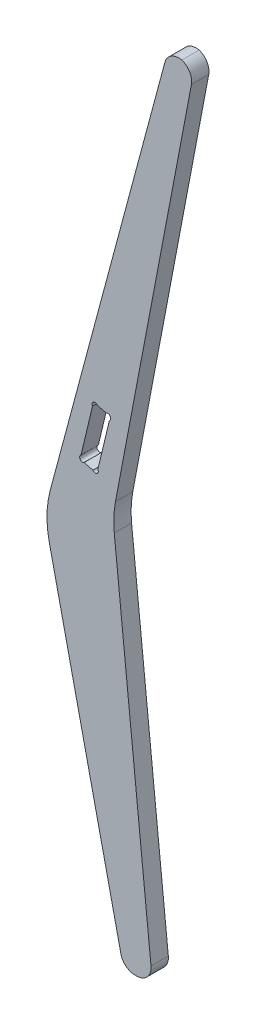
ISO-10303-21;
HEADER;
FILE_DESCRIPTION(('STEP AP214'),'2;1');
FILE_NAME('part.step','',(''),(''),'','','');
FILE_SCHEMA(('AUTOMOTIVE_DESIGN { 1 0 10303 214 1 1 1 1 }'));
ENDSEC;
DATA;
#1=APPLICATION_CONTEXT('core data for automotive mechanical design processes');
#2=APPLICATION_PROTOCOL_DEFINITION('international standard','automotive_design',2000,#1);
#3=PRODUCT_CONTEXT('',#1,'mechanical');
#4=PRODUCT('Part','Part','',(#3));
#5=PRODUCT_RELATED_PRODUCT_CATEGORY('part','',(#4));
#6=PRODUCT_DEFINITION_FORMATION('','',#4);
#7=PRODUCT_DEFINITION_CONTEXT('part definition',#1,'design');
#8=PRODUCT_DEFINITION('design','',#6,#7);
#9=PRODUCT_DEFINITION_SHAPE('','',#8);
#10=(LENGTH_UNIT() NAMED_UNIT(*) SI_UNIT(.MILLI.,.METRE.));
#11=(NAMED_UNIT(*) PLANE_ANGLE_UNIT() SI_UNIT($,.RADIAN.));
#12=(NAMED_UNIT(*) SI_UNIT($,.STERADIAN.) SOLID_ANGLE_UNIT());
#13=UNCERTAINTY_MEASURE_WITH_UNIT(LENGTH_MEASURE(1.E-05),#10,'distance_accuracy_value','');
#14=(GEOMETRIC_REPRESENTATION_CONTEXT(3) GLOBAL_UNCERTAINTY_ASSIGNED_CONTEXT((#13)) GLOBAL_UNIT_ASSIGNED_CONTEXT((#10,
#11,#12)) REPRESENTATION_CONTEXT('',''));
#15=CARTESIAN_POINT('',(0.,0.,0.));
#16=DIRECTION('',(0.,0.,1.));
#17=DIRECTION('',(1.,0.,0.));
#18=AXIS2_PLACEMENT_3D('',#15,#16,#17);
#19=CARTESIAN_POINT('',(19.9991991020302,83.5068127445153,18.));
#20=DIRECTION('',(0.232905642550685,0.97249933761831,0.));
#21=DIRECTION('',(-0.97249933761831,0.232905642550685,0.));
#22=AXIS2_PLACEMENT_3D('',#19,#20,#21);
#23=PLANE('',#22);
#24=DIRECTION('',(0.97249933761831,-0.232905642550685,0.));
#25=VECTOR('',#24,1.);
#26=CARTESIAN_POINT('',(19.9991991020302,83.5068127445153,0.));
#27=LINE('',#26,#25);
#28=CARTESIAN_POINT('',(196.781458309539,41.1689066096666,0.));
#29=VERTEX_POINT('',#28);
#30=CARTESIAN_POINT('',(206.034515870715,38.9528749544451,0.));
#31=VERTEX_POINT('',#30);
#32=EDGE_CURVE('E180',#29,#31,#27,.T.);
#33=ORIENTED_EDGE('',*,*,#32,.T.);
#34=DIRECTION('',(0.,0.,1.));
#35=VECTOR('',#34,1.);
#36=CARTESIAN_POINT('',(206.034515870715,38.9528749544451,0.));
#37=LINE('',#36,#35);
#38=CARTESIAN_POINT('',(206.034515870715,38.9528749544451,18.));
#39=VERTEX_POINT('',#38);
#40=EDGE_CURVE('E269',#31,#39,#37,.T.);
#41=ORIENTED_EDGE('',*,*,#40,.T.);
#42=DIRECTION('',(0.97249933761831,-0.232905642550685,0.));
#43=VECTOR('',#42,1.);
#44=CARTESIAN_POINT('',(19.9991991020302,83.5068127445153,18.));
#45=LINE('',#44,#43);
#46=CARTESIAN_POINT('',(196.781458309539,41.1689066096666,18.));
#47=VERTEX_POINT('',#46);
#48=EDGE_CURVE('E182',#47,#39,#45,.T.);
#49=ORIENTED_EDGE('',*,*,#48,.F.);
#50=DIRECTION('',(0.,0.,1.));
#51=VECTOR('',#50,1.);
#52=CARTESIAN_POINT('',(196.781458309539,41.1689066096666,0.));
#53=LINE('',#52,#51);
#54=EDGE_CURVE('E167',#47,#29,#53,.F.);
#55=ORIENTED_EDGE('',*,*,#54,.T.);
#56=EDGE_LOOP('',(#33,#41,#49,#55));
#57=FACE_BOUND('',#56,.T.);
#58=ADVANCED_FACE('F35',(#57),#23,.F.);
#59=CARTESIAN_POINT('',(190.161282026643,-45.5420727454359,18.));
#60=DIRECTION('',(0.972499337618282,-0.232905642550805,0.));
#61=DIRECTION('',(0.232905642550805,0.972499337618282,0.));
#62=AXIS2_PLACEMENT_3D('',#59,#60,#61);
#63=PLANE('',#62);
#64=DIRECTION('',(-0.232905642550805,-0.972499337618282,0.));
#65=VECTOR('',#64,1.);
#66=CARTESIAN_POINT('',(190.161282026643,-45.5420727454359,0.));
#67=LINE('',#66,#65);
#68=CARTESIAN_POINT('',(209.172346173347,33.8387747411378,0.));
#69=VERTEX_POINT('',#68);
#70=CARTESIAN_POINT('',(197.174277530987,-16.2592550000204,0.));
#71=VERTEX_POINT('',#70);
#72=EDGE_CURVE('E188',#69,#71,#67,.T.);
#73=ORIENTED_EDGE('',*,*,#72,.T.);
#74=DIRECTION('',(0.,0.,1.));
#75=VECTOR('',#74,1.);
#76=CARTESIAN_POINT('',(197.174277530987,-16.2592550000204,0.));
#77=LINE('',#76,#75);
#78=CARTESIAN_POINT('',(197.174277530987,-16.2592550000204,18.));
#79=VERTEX_POINT('',#78);
#80=EDGE_CURVE('E50',#71,#79,#77,.T.);
#81=ORIENTED_EDGE('',*,*,#80,.T.);
#82=DIRECTION('',(-0.232905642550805,-0.972499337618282,0.));
#83=VECTOR('',#82,1.);
#84=CARTESIAN_POINT('',(190.161282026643,-45.5420727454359,18.));
#85=LINE('',#84,#83);
#86=CARTESIAN_POINT('',(209.172346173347,33.8387747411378,18.));
#87=VERTEX_POINT('',#86);
#88=EDGE_CURVE('E267',#87,#79,#85,.T.);
#89=ORIENTED_EDGE('',*,*,#88,.F.);
#90=DIRECTION('',(0.,0.,1.));
#91=VECTOR('',#90,1.);
#92=CARTESIAN_POINT('',(209.172346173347,33.8387747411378,0.));
#93=LINE('',#92,#91);
#94=EDGE_CURVE('E183',#87,#69,#93,.F.);
#95=ORIENTED_EDGE('',*,*,#94,.T.);
#96=EDGE_LOOP('',(#73,#81,#89,#95));
#97=FACE_BOUND('',#96,.T.);
#98=ADVANCED_FACE('F263',(#97),#63,.F.);
#99=CARTESIAN_POINT('',(6.02486054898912,25.1568524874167,18.));
#100=DIRECTION('',(0.232905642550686,0.97249933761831,0.));
#101=DIRECTION('',(-0.97249933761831,0.232905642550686,0.));
#102=AXIS2_PLACEMENT_3D('',#99,#100,#101);
#103=PLANE('',#102);
#104=DIRECTION('',(0.,0.,1.));
#105=VECTOR('',#104,1.);
#106=CARTESIAN_POINT('',(182.807119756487,-17.1810536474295,0.));
#107=LINE('',#106,#105);
#108=CARTESIAN_POINT('',(182.807119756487,-17.1810536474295,18.));
#109=VERTEX_POINT('',#108);
#110=CARTESIAN_POINT('',(182.807119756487,-17.1810536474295,0.));
#111=VERTEX_POINT('',#110);
#112=EDGE_CURVE('E280',#109,#111,#107,.F.);
#113=ORIENTED_EDGE('',*,*,#112,.F.);
#114=DIRECTION('',(0.97249933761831,-0.232905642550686,0.));
#115=VECTOR('',#114,1.);
#116=CARTESIAN_POINT('',(6.02486054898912,25.1568524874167,18.));
#117=LINE('',#116,#115);
#118=CARTESIAN_POINT('',(192.060177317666,-19.3970853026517,18.));
#119=VERTEX_POINT('',#118);
#120=EDGE_CURVE('E298',#109,#119,#117,.T.);
#121=ORIENTED_EDGE('',*,*,#120,.T.);
#122=DIRECTION('',(0.,0.,1.));
#123=VECTOR('',#122,1.);
#124=CARTESIAN_POINT('',(192.060177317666,-19.3970853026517,0.));
#125=LINE('',#124,#123);
#126=CARTESIAN_POINT('',(192.060177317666,-19.3970853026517,0.));
#127=VERTEX_POINT('',#126);
#128=EDGE_CURVE('E271',#127,#119,#125,.T.);
#129=ORIENTED_EDGE('',*,*,#128,.F.);
#130=DIRECTION('',(0.97249933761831,-0.232905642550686,0.));
#131=VECTOR('',#130,1.);
#132=CARTESIAN_POINT('',(6.02486054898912,25.1568524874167,0.));
#133=LINE('',#132,#131);
#134=EDGE_CURVE('E192',#111,#127,#133,.T.);
#135=ORIENTED_EDGE('',*,*,#134,.F.);
#136=EDGE_LOOP('',(#113,#121,#129,#135));
#137=FACE_BOUND('',#136,.T.);
#138=ADVANCED_FACE('F379',(#137),#103,.T.);
#139=CARTESIAN_POINT('',(205.380018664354,21.1630051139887,18.));
#140=DIRECTION('',(0.994732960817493,0.10250042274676,0.));
#141=DIRECTION('',(-0.10250042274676,0.994732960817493,0.));
#142=AXIS2_PLACEMENT_3D('',#139,#140,#141);
#143=PLANE('',#142);
#144=DIRECTION('',(0.10250042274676,-0.994732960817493,0.));
#145=VECTOR('',#144,1.);
#146=CARTESIAN_POINT('',(205.380018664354,21.1630051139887,18.));
#147=LINE('',#146,#145);
#148=CARTESIAN_POINT('',(214.256184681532,-64.9772728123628,18.));
#149=VERTEX_POINT('',#148);
#150=CARTESIAN_POINT('',(252.445302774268,-435.590129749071,18.));
#151=VERTEX_POINT('',#150);
#152=EDGE_CURVE('E201',#149,#151,#147,.T.);
#153=ORIENTED_EDGE('',*,*,#152,.T.);
#154=DIRECTION('',(0.,0.,1.));
#155=VECTOR('',#154,1.);
#156=CARTESIAN_POINT('',(252.445302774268,-435.590129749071,18.));
#157=LINE('',#156,#155);
#158=CARTESIAN_POINT('',(252.445302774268,-435.590129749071,0.));
#159=VERTEX_POINT('',#158);
#160=EDGE_CURVE('E250',#151,#159,#157,.F.);
#161=ORIENTED_EDGE('',*,*,#160,.T.);
#162=DIRECTION('',(0.10250042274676,-0.994732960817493,0.));
#163=VECTOR('',#162,1.);
#164=CARTESIAN_POINT('',(205.380018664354,21.1630051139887,0.));
#165=LINE('',#164,#163);
#166=CARTESIAN_POINT('',(214.256184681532,-64.9772728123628,0.));
#167=VERTEX_POINT('',#166);
#168=EDGE_CURVE('E240',#167,#159,#165,.T.);
#169=ORIENTED_EDGE('',*,*,#168,.F.);
#170=DIRECTION('',(0.,0.,-1.));
#171=VECTOR('',#170,1.);
#172=CARTESIAN_POINT('',(214.256184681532,-64.9772728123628,18.));
#173=LINE('',#172,#171);
#174=EDGE_CURVE('E216',#167,#149,#173,.F.);
#175=ORIENTED_EDGE('',*,*,#174,.T.);
#176=EDGE_LOOP('',(#153,#161,#169,#175));
#177=FACE_BOUND('',#176,.T.);
#178=ADVANCED_FACE('F335',(#177),#143,.T.);
#179=CARTESIAN_POINT('',(214.580040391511,-40.8280444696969,18.));
#180=DIRECTION('',(0.982375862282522,-0.18691619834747,0.));
#181=DIRECTION('',(0.18691619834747,0.982375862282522,0.));
#182=AXIS2_PLACEMENT_3D('',#179,#180,#181);
#183=PLANE('',#182);
#184=DIRECTION('',(-0.18691619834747,-0.982375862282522,0.));
#185=VECTOR('',#184,1.);
#186=CARTESIAN_POINT('',(214.580040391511,-40.8280444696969,0.));
#187=LINE('',#186,#185);
#188=CARTESIAN_POINT('',(294.461269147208,379.003899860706,0.));
#189=VERTEX_POINT('',#188);
#190=CARTESIAN_POINT('',(215.491894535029,-36.0356107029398,0.));
#191=VERTEX_POINT('',#190);
#192=EDGE_CURVE('E305',#189,#191,#187,.T.);
#193=ORIENTED_EDGE('',*,*,#192,.F.);
#194=DIRECTION('',(0.,0.,-1.));
#195=VECTOR('',#194,1.);
#196=CARTESIAN_POINT('',(294.461269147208,379.003899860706,18.));
#197=LINE('',#196,#195);
#198=CARTESIAN_POINT('',(294.461269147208,379.003899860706,18.));
#199=VERTEX_POINT('',#198);
#200=EDGE_CURVE('E227',#189,#199,#197,.F.);
#201=ORIENTED_EDGE('',*,*,#200,.T.);
#202=DIRECTION('',(-0.18691619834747,-0.982375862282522,0.));
#203=VECTOR('',#202,1.);
#204=CARTESIAN_POINT('',(214.580040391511,-40.8280444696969,18.));
#205=LINE('',#204,#203);
#206=CARTESIAN_POINT('',(215.491894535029,-36.0356107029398,18.));
#207=VERTEX_POINT('',#206);
#208=EDGE_CURVE('E289',#199,#207,#205,.T.);
#209=ORIENTED_EDGE('',*,*,#208,.T.);
#210=DIRECTION('',(0.,0.,-1.));
#211=VECTOR('',#210,1.);
#212=CARTESIAN_POINT('',(215.491894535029,-36.0356107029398,0.));
#213=LINE('',#212,#211);
#214=EDGE_CURVE('E213',#207,#191,#213,.T.);
#215=ORIENTED_EDGE('',*,*,#214,.T.);
#216=EDGE_LOOP('',(#193,#201,#209,#215));
#217=FACE_BOUND('',#216,.T.);
#218=ADVANCED_FACE('F325',(#217),#183,.T.);
#219=CARTESIAN_POINT('',(152.70694147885,-40.9177016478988,18.));
#220=DIRECTION('',(-0.965925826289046,0.258819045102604,0.));
#221=DIRECTION('',(-0.258819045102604,-0.965925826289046,0.));
#222=AXIS2_PLACEMENT_3D('',#219,#220,#221);
#223=PLANE('',#222);
#224=DIRECTION('',(0.258819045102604,0.965925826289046,0.));
#225=VECTOR('',#224,1.);
#226=CARTESIAN_POINT('',(152.70694147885,-40.9177016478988,18.));
#227=LINE('',#226,#225);
#228=CARTESIAN_POINT('',(147.72580841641,-59.5075433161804,18.));
#229=VERTEX_POINT('',#228);
#230=CARTESIAN_POINT('',(266.896916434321,385.245086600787,18.));
#231=VERTEX_POINT('',#230);
#232=EDGE_CURVE('E291',#229,#231,#227,.T.);
#233=ORIENTED_EDGE('',*,*,#232,.T.);
#234=DIRECTION('',(0.,0.,-1.));
#235=VECTOR('',#234,1.);
#236=CARTESIAN_POINT('',(266.896916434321,385.245086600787,18.));
#237=LINE('',#236,#235);
#238=CARTESIAN_POINT('',(266.896916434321,385.245086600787,0.));
#239=VERTEX_POINT('',#238);
#240=EDGE_CURVE('E234',#231,#239,#237,.T.);
#241=ORIENTED_EDGE('',*,*,#240,.T.);
#242=DIRECTION('',(0.258819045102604,0.965925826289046,0.));
#243=VECTOR('',#242,1.);
#244=CARTESIAN_POINT('',(152.70694147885,-40.9177016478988,0.));
#245=LINE('',#244,#243);
#246=CARTESIAN_POINT('',(147.72580841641,-59.5075433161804,0.));
#247=VERTEX_POINT('',#246);
#248=EDGE_CURVE('E194',#247,#239,#245,.T.);
#249=ORIENTED_EDGE('',*,*,#248,.F.);
#250=DIRECTION('',(0.,0.,-1.));
#251=VECTOR('',#250,1.);
#252=CARTESIAN_POINT('',(147.72580841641,-59.5075433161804,18.));
#253=LINE('',#252,#251);
#254=EDGE_CURVE('E208',#247,#229,#253,.F.);
#255=ORIENTED_EDGE('',*,*,#254,.T.);
#256=EDGE_LOOP('',(#233,#241,#249,#255));
#257=FACE_BOUND('',#256,.T.);
#258=ADVANCED_FACE('F358',(#257),#223,.T.);
#259=CARTESIAN_POINT('',(116.93444675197,26.1283123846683,18.));
#260=DIRECTION('',(-0.975933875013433,-0.218066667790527,0.));
#261=DIRECTION('',(0.218066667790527,-0.975933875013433,0.));
#262=AXIS2_PLACEMENT_3D('',#259,#260,#261);
#263=PLANE('',#262);
#264=DIRECTION('',(-0.218066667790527,0.975933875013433,0.));
#265=VECTOR('',#264,1.);
#266=CARTESIAN_POINT('',(116.93444675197,26.1283123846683,0.));
#267=LINE('',#266,#265);
#268=CARTESIAN_POINT('',(221.1771415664,-440.39863610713,0.));
#269=VERTEX_POINT('',#268);
#270=CARTESIAN_POINT('',(146.725003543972,-107.196114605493,0.));
#271=VERTEX_POINT('',#270);
#272=EDGE_CURVE('E189',#269,#271,#267,.T.);
#273=ORIENTED_EDGE('',*,*,#272,.F.);
#274=DIRECTION('',(0.,0.,1.));
#275=VECTOR('',#274,1.);
#276=CARTESIAN_POINT('',(221.1771415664,-440.39863610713,18.));
#277=LINE('',#276,#275);
#278=CARTESIAN_POINT('',(221.1771415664,-440.39863610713,18.));
#279=VERTEX_POINT('',#278);
#280=EDGE_CURVE('E174',#269,#279,#277,.T.);
#281=ORIENTED_EDGE('',*,*,#280,.T.);
#282=DIRECTION('',(-0.218066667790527,0.975933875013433,0.));
#283=VECTOR('',#282,1.);
#284=CARTESIAN_POINT('',(116.93444675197,26.1283123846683,18.));
#285=LINE('',#284,#283);
#286=CARTESIAN_POINT('',(146.725003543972,-107.196114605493,18.));
#287=VERTEX_POINT('',#286);
#288=EDGE_CURVE('E294',#279,#287,#285,.T.);
#289=ORIENTED_EDGE('',*,*,#288,.T.);
#290=DIRECTION('',(0.,0.,-1.));
#291=VECTOR('',#290,1.);
#292=CARTESIAN_POINT('',(146.725003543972,-107.196114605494,18.));
#293=LINE('',#292,#291);
#294=EDGE_CURVE('E202',#287,#271,#293,.T.);
#295=ORIENTED_EDGE('',*,*,#294,.T.);
#296=EDGE_LOOP('',(#273,#281,#289,#295));
#297=FACE_BOUND('',#296,.T.);
#298=ADVANCED_FACE('F351',(#297),#263,.T.);
#299=CARTESIAN_POINT('',(172.656293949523,-41.3497711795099,18.));
#300=DIRECTION('',(0.972499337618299,-0.232905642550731,0.));
#301=DIRECTION('',(0.232905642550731,0.972499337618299,0.));
#302=AXIS2_PLACEMENT_3D('',#299,#300,#301);
#303=PLANE('',#302);
#304=DIRECTION('',(0.,0.,1.));
#305=VECTOR('',#304,1.);
#306=CARTESIAN_POINT('',(179.669289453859,-12.0669534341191,0.));
#307=LINE('',#306,#305);
#308=CARTESIAN_POINT('',(179.669289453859,-12.0669534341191,0.));
#309=VERTEX_POINT('',#308);
#310=CARTESIAN_POINT('',(179.669289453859,-12.0669534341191,18.));
#311=VERTEX_POINT('',#310);
#312=EDGE_CURVE('E277',#309,#311,#307,.T.);
#313=ORIENTED_EDGE('',*,*,#312,.F.);
#314=DIRECTION('',(-0.232905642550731,-0.972499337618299,0.));
#315=VECTOR('',#314,1.);
#316=CARTESIAN_POINT('',(172.656293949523,-41.3497711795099,0.));
#317=LINE('',#316,#315);
#318=CARTESIAN_POINT('',(191.667358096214,38.0310763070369,0.));
#319=VERTEX_POINT('',#318);
#320=EDGE_CURVE('E199',#319,#309,#317,.T.);
#321=ORIENTED_EDGE('',*,*,#320,.F.);
#322=DIRECTION('',(0.,0.,1.));
#323=VECTOR('',#322,1.);
#324=CARTESIAN_POINT('',(191.667358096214,38.031076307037,0.));
#325=LINE('',#324,#323);
#326=CARTESIAN_POINT('',(191.667358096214,38.031076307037,18.));
#327=VERTEX_POINT('',#326);
#328=EDGE_CURVE('E170',#327,#319,#325,.F.);
#329=ORIENTED_EDGE('',*,*,#328,.F.);
#330=DIRECTION('',(-0.232905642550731,-0.972499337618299,0.));
#331=VECTOR('',#330,1.);
#332=CARTESIAN_POINT('',(172.656293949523,-41.3497711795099,18.));
#333=LINE('',#332,#331);
#334=EDGE_CURVE('E206',#327,#311,#333,.T.);
#335=ORIENTED_EDGE('',*,*,#334,.T.);
#336=EDGE_LOOP('',(#313,#321,#329,#335));
#337=FACE_BOUND('',#336,.T.);
#338=ADVANCED_FACE('F362',(#337),#303,.T.);
#339=CARTESIAN_POINT('',(0.,0.,18.));
#340=DIRECTION('',(0.,0.,1.));
#341=DIRECTION('',(1.,0.,0.));
#342=AXIS2_PLACEMENT_3D('',#339,#340,#341);
#343=PLANE('',#342);
#344=CARTESIAN_POINT('',(181.238204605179,-14.6240035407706,18.));
#345=DIRECTION('',(0.,0.,1.));
#346=DIRECTION('',(-1.,0.,0.));
#347=AXIS2_PLACEMENT_3D('',#344,#345,#346);
#348=CIRCLE('',#347,2.99999999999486);
#349=EDGE_CURVE('E427',#311,#109,#348,.T.);
#350=ORIENTED_EDGE('',*,*,#349,.F.);
#351=ORIENTED_EDGE('',*,*,#334,.F.);
#352=CARTESIAN_POINT('',(194.224408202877,39.5999914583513,18.));
#353=DIRECTION('',(0.,0.,1.));
#354=DIRECTION('',(1.,0.,0.));
#355=AXIS2_PLACEMENT_3D('',#352,#353,#354);
#356=CIRCLE('',#355,3.00000000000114);
#357=EDGE_CURVE('E422',#47,#327,#356,.T.);
#358=ORIENTED_EDGE('',*,*,#357,.F.);
#359=ORIENTED_EDGE('',*,*,#48,.T.);
#360=CARTESIAN_POINT('',(207.603431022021,36.3958248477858,18.));
#361=DIRECTION('',(0.,0.,1.));
#362=DIRECTION('',(-1.,0.,0.));
#363=AXIS2_PLACEMENT_3D('',#360,#361,#362);
#364=CIRCLE('',#363,2.99999999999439);
#365=EDGE_CURVE('E420',#87,#39,#364,.T.);
#366=ORIENTED_EDGE('',*,*,#365,.F.);
#367=ORIENTED_EDGE('',*,*,#88,.T.);
#368=CARTESIAN_POINT('',(194.617227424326,-17.8281701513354,18.));
#369=DIRECTION('',(0.,0.,1.));
#370=DIRECTION('',(1.,0.,0.));
#371=AXIS2_PLACEMENT_3D('',#368,#369,#370);
#372=CIRCLE('',#371,2.99999999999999);
#373=EDGE_CURVE('E424',#119,#79,#372,.T.);
#374=ORIENTED_EDGE('',*,*,#373,.F.);
#375=ORIENTED_EDGE('',*,*,#120,.F.);
#376=EDGE_LOOP('',(#350,#351,#358,#359,#366,#367,#374,#375));
#377=FACE_BOUND('',#376,.T.);
#378=DIRECTION('',(1.,0.,0.));
#379=VECTOR('',#378,1.);
#380=CARTESIAN_POINT('',(254.149379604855,-452.127636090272,18.));
#381=LINE('',#380,#379);
#382=CARTESIAN_POINT('',(235.816149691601,-452.127636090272,18.));
#383=VERTEX_POINT('',#382);
#384=CARTESIAN_POINT('',(237.524308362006,-452.127636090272,18.));
#385=VERTEX_POINT('',#384);
#386=EDGE_CURVE('E282',#383,#385,#381,.T.);
#387=ORIENTED_EDGE('',*,*,#386,.T.);
#388=CARTESIAN_POINT('',(237.524308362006,-437.127636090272,18.));
#389=DIRECTION('',(0.,0.,1.));
#390=DIRECTION('',(1.,0.,0.));
#391=AXIS2_PLACEMENT_3D('',#388,#389,#390);
#392=CIRCLE('',#391,15.);
#393=EDGE_CURVE('E248',#385,#151,#392,.T.);
#394=ORIENTED_EDGE('',*,*,#393,.T.);
#395=ORIENTED_EDGE('',*,*,#152,.F.);
#396=CARTESIAN_POINT('',(313.729480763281,-54.7272305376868,18.));
#397=DIRECTION('',(0.,0.,1.));
#398=DIRECTION('',(1.,0.,0.));
#399=AXIS2_PLACEMENT_3D('',#396,#397,#398);
#400=CIRCLE('',#399,100.);
#401=EDGE_CURVE('E220',#149,#207,#400,.F.);
#402=ORIENTED_EDGE('',*,*,#401,.T.);
#403=ORIENTED_EDGE('',*,*,#208,.F.);
#404=CARTESIAN_POINT('',(279.72563121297,381.807642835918,18.));
#405=DIRECTION('',(0.,0.,1.));
#406=DIRECTION('',(1.,0.,0.));
#407=AXIS2_PLACEMENT_3D('',#404,#405,#406);
#408=CIRCLE('',#407,15.);
#409=CARTESIAN_POINT('',(284.431626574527,396.050311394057,18.));
#410=VERTEX_POINT('',#409);
#411=EDGE_CURVE('E232',#199,#410,#408,.T.);
#412=ORIENTED_EDGE('',*,*,#411,.T.);
#413=CARTESIAN_POINT('',(281.385803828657,381.362800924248,18.));
#414=DIRECTION('',(0.,0.,1.));
#415=DIRECTION('',(1.,0.,0.));
#416=AXIS2_PLACEMENT_3D('',#413,#414,#415);
#417=CIRCLE('',#416,15.);
#418=EDGE_CURVE('E230',#410,#231,#417,.T.);
#419=ORIENTED_EDGE('',*,*,#418,.T.);
#420=ORIENTED_EDGE('',*,*,#232,.F.);
#421=CARTESIAN_POINT('',(244.318391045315,-85.3894478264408,18.));
#422=DIRECTION('',(0.,0.,1.));
#423=DIRECTION('',(1.,0.,0.));
#424=AXIS2_PLACEMENT_3D('',#421,#422,#423);
#425=CIRCLE('',#424,100.);
#426=EDGE_CURVE('E210',#229,#287,#425,.T.);
#427=ORIENTED_EDGE('',*,*,#426,.T.);
#428=ORIENTED_EDGE('',*,*,#288,.F.);
#429=CARTESIAN_POINT('',(235.816149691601,-437.127636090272,18.));
#430=DIRECTION('',(0.,0.,1.));
#431=DIRECTION('',(1.,0.,0.));
#432=AXIS2_PLACEMENT_3D('',#429,#430,#431);
#433=CIRCLE('',#432,15.);
#434=EDGE_CURVE('E246',#279,#383,#433,.T.);
#435=ORIENTED_EDGE('',*,*,#434,.T.);
#436=EDGE_LOOP('',(#387,#394,#395,#402,#403,#412,#419,#420,#427,#428,#435));
#437=FACE_BOUND('',#436,.T.);
#438=ADVANCED_FACE('F360',(#377,#437),#343,.T.);
#439=CARTESIAN_POINT('',(0.,0.,0.));
#440=DIRECTION('',(0.,0.,1.));
#441=DIRECTION('',(1.,0.,0.));
#442=AXIS2_PLACEMENT_3D('',#439,#440,#441);
#443=PLANE('',#442);
#444=ORIENTED_EDGE('',*,*,#168,.T.);
#445=CARTESIAN_POINT('',(237.524308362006,-437.127636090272,0.));
#446=DIRECTION('',(0.,0.,1.));
#447=DIRECTION('',(1.,0.,0.));
#448=AXIS2_PLACEMENT_3D('',#445,#446,#447);
#449=CIRCLE('',#448,15.);
#450=CARTESIAN_POINT('',(237.524308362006,-452.127636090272,0.));
#451=VERTEX_POINT('',#450);
#452=EDGE_CURVE('E254',#159,#451,#449,.F.);
#453=ORIENTED_EDGE('',*,*,#452,.T.);
#454=DIRECTION('',(1.,0.,0.));
#455=VECTOR('',#454,1.);
#456=CARTESIAN_POINT('',(254.149379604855,-452.127636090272,0.));
#457=LINE('',#456,#455);
#458=CARTESIAN_POINT('',(235.816149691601,-452.127636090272,0.));
#459=VERTEX_POINT('',#458);
#460=EDGE_CURVE('E241',#459,#451,#457,.T.);
#461=ORIENTED_EDGE('',*,*,#460,.F.);
#462=CARTESIAN_POINT('',(235.816149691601,-437.127636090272,0.));
#463=DIRECTION('',(0.,0.,1.));
#464=DIRECTION('',(1.,0.,0.));
#465=AXIS2_PLACEMENT_3D('',#462,#463,#464);
#466=CIRCLE('',#465,15.);
#467=EDGE_CURVE('E252',#459,#269,#466,.F.);
#468=ORIENTED_EDGE('',*,*,#467,.T.);
#469=ORIENTED_EDGE('',*,*,#272,.T.);
#470=CARTESIAN_POINT('',(244.318391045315,-85.3894478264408,0.));
#471=DIRECTION('',(0.,0.,1.));
#472=DIRECTION('',(1.,0.,0.));
#473=AXIS2_PLACEMENT_3D('',#470,#471,#472);
#474=CIRCLE('',#473,100.);
#475=EDGE_CURVE('E205',#271,#247,#474,.F.);
#476=ORIENTED_EDGE('',*,*,#475,.T.);
#477=ORIENTED_EDGE('',*,*,#248,.T.);
#478=CARTESIAN_POINT('',(281.385803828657,381.362800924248,0.));
#479=DIRECTION('',(0.,0.,1.));
#480=DIRECTION('',(1.,0.,0.));
#481=AXIS2_PLACEMENT_3D('',#478,#479,#480);
#482=CIRCLE('',#481,15.);
#483=CARTESIAN_POINT('',(284.431626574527,396.050311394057,0.));
#484=VERTEX_POINT('',#483);
#485=EDGE_CURVE('E223',#239,#484,#482,.F.);
#486=ORIENTED_EDGE('',*,*,#485,.T.);
#487=CARTESIAN_POINT('',(279.72563121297,381.807642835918,0.));
#488=DIRECTION('',(0.,0.,1.));
#489=DIRECTION('',(1.,0.,0.));
#490=AXIS2_PLACEMENT_3D('',#487,#488,#489);
#491=CIRCLE('',#490,15.);
#492=EDGE_CURVE('E225',#484,#189,#491,.F.);
#493=ORIENTED_EDGE('',*,*,#492,.T.);
#494=ORIENTED_EDGE('',*,*,#192,.T.);
#495=CARTESIAN_POINT('',(313.729480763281,-54.7272305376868,0.));
#496=DIRECTION('',(0.,0.,1.));
#497=DIRECTION('',(1.,0.,0.));
#498=AXIS2_PLACEMENT_3D('',#495,#496,#497);
#499=CIRCLE('',#498,100.);
#500=EDGE_CURVE('E218',#191,#167,#499,.T.);
#501=ORIENTED_EDGE('',*,*,#500,.T.);
#502=EDGE_LOOP('',(#444,#453,#461,#468,#469,#476,#477,#486,#493,#494,#501));
#503=FACE_BOUND('',#502,.T.);
#504=ORIENTED_EDGE('',*,*,#320,.T.);
#505=CARTESIAN_POINT('',(181.238204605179,-14.6240035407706,0.));
#506=DIRECTION('',(0.,0.,1.));
#507=DIRECTION('',(1.,0.,0.));
#508=AXIS2_PLACEMENT_3D('',#505,#506,#507);
#509=CIRCLE('',#508,2.99999999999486);
#510=EDGE_CURVE('E11',#309,#111,#509,.T.);
#511=ORIENTED_EDGE('',*,*,#510,.T.);
#512=ORIENTED_EDGE('',*,*,#134,.T.);
#513=CARTESIAN_POINT('',(194.617227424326,-17.8281701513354,0.));
#514=DIRECTION('',(0.,0.,1.));
#515=DIRECTION('',(1.,0.,0.));
#516=AXIS2_PLACEMENT_3D('',#513,#514,#515);
#517=CIRCLE('',#516,2.99999999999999);
#518=EDGE_CURVE('E43',#127,#71,#517,.T.);
#519=ORIENTED_EDGE('',*,*,#518,.T.);
#520=ORIENTED_EDGE('',*,*,#72,.F.);
#521=CARTESIAN_POINT('',(207.603431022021,36.3958248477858,0.));
#522=DIRECTION('',(0.,0.,1.));
#523=DIRECTION('',(1.,0.,0.));
#524=AXIS2_PLACEMENT_3D('',#521,#522,#523);
#525=CIRCLE('',#524,2.99999999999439);
#526=EDGE_CURVE('E173',#69,#31,#525,.T.);
#527=ORIENTED_EDGE('',*,*,#526,.T.);
#528=ORIENTED_EDGE('',*,*,#32,.F.);
#529=CARTESIAN_POINT('',(194.224408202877,39.5999914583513,0.));
#530=DIRECTION('',(0.,0.,1.));
#531=DIRECTION('',(1.,0.,0.));
#532=AXIS2_PLACEMENT_3D('',#529,#530,#531);
#533=CIRCLE('',#532,3.00000000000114);
#534=EDGE_CURVE('E164',#29,#319,#533,.T.);
#535=ORIENTED_EDGE('',*,*,#534,.T.);
#536=EDGE_LOOP('',(#504,#511,#512,#519,#520,#527,#528,#535));
#537=FACE_BOUND('',#536,.T.);
#538=ADVANCED_FACE('F186',(#503,#537),#443,.F.);
#539=CARTESIAN_POINT('',(244.318391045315,-85.3894478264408,18.));
#540=DIRECTION('',(0.,0.,-1.));
#541=DIRECTION('',(-1.,0.,0.));
#542=AXIS2_PLACEMENT_3D('',#539,#540,#541);
#543=CYLINDRICAL_SURFACE('',#542,100.);
#544=ORIENTED_EDGE('',*,*,#426,.F.);
#545=ORIENTED_EDGE('',*,*,#254,.F.);
#546=ORIENTED_EDGE('',*,*,#475,.F.);
#547=ORIENTED_EDGE('',*,*,#294,.F.);
#548=EDGE_LOOP('',(#544,#545,#546,#547));
#549=FACE_BOUND('',#548,.T.);
#550=ADVANCED_FACE('F356',(#549),#543,.T.);
#551=CARTESIAN_POINT('',(313.729480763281,-54.7272305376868,18.));
#552=DIRECTION('',(0.,0.,1.));
#553=DIRECTION('',(1.,0.,0.));
#554=AXIS2_PLACEMENT_3D('',#551,#552,#553);
#555=CYLINDRICAL_SURFACE('',#554,100.);
#556=ORIENTED_EDGE('',*,*,#401,.F.);
#557=ORIENTED_EDGE('',*,*,#174,.F.);
#558=ORIENTED_EDGE('',*,*,#500,.F.);
#559=ORIENTED_EDGE('',*,*,#214,.F.);
#560=EDGE_LOOP('',(#556,#557,#558,#559));
#561=FACE_BOUND('',#560,.T.);
#562=ADVANCED_FACE('F330',(#561),#555,.F.);
#563=CARTESIAN_POINT('',(281.385803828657,381.362800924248,18.));
#564=DIRECTION('',(0.,0.,-1.));
#565=DIRECTION('',(-1.,0.,0.));
#566=AXIS2_PLACEMENT_3D('',#563,#564,#565);
#567=CYLINDRICAL_SURFACE('',#566,15.);
#568=ORIENTED_EDGE('',*,*,#240,.F.);
#569=ORIENTED_EDGE('',*,*,#418,.F.);
#570=DIRECTION('',(0.,0.,-1.));
#571=VECTOR('',#570,1.);
#572=CARTESIAN_POINT('',(284.431626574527,396.050311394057,9.));
#573=LINE('',#572,#571);
#574=EDGE_CURVE('E237',#484,#410,#573,.F.);
#575=ORIENTED_EDGE('',*,*,#574,.F.);
#576=ORIENTED_EDGE('',*,*,#485,.F.);
#577=EDGE_LOOP('',(#568,#569,#575,#576));
#578=FACE_BOUND('',#577,.T.);
#579=ADVANCED_FACE('F316',(#578),#567,.T.);
#580=CARTESIAN_POINT('',(279.72563121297,381.807642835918,18.));
#581=DIRECTION('',(0.,0.,-1.));
#582=DIRECTION('',(-1.,0.,0.));
#583=AXIS2_PLACEMENT_3D('',#580,#581,#582);
#584=CYLINDRICAL_SURFACE('',#583,15.);
#585=ORIENTED_EDGE('',*,*,#411,.F.);
#586=ORIENTED_EDGE('',*,*,#200,.F.);
#587=ORIENTED_EDGE('',*,*,#492,.F.);
#588=ORIENTED_EDGE('',*,*,#574,.T.);
#589=EDGE_LOOP('',(#585,#586,#587,#588));
#590=FACE_BOUND('',#589,.T.);
#591=ADVANCED_FACE('F321',(#590),#584,.T.);
#592=CARTESIAN_POINT('',(254.149379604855,-452.127636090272,0.));
#593=DIRECTION('',(0.,-1.,0.));
#594=DIRECTION('',(0.,0.,-1.));
#595=AXIS2_PLACEMENT_3D('',#592,#593,#594);
#596=PLANE('',#595);
#597=ORIENTED_EDGE('',*,*,#460,.T.);
#598=DIRECTION('',(0.,0.,1.));
#599=VECTOR('',#598,1.);
#600=CARTESIAN_POINT('',(237.524308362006,-452.127636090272,0.));
#601=LINE('',#600,#599);
#602=EDGE_CURVE('E243',#451,#385,#601,.T.);
#603=ORIENTED_EDGE('',*,*,#602,.T.);
#604=ORIENTED_EDGE('',*,*,#386,.F.);
#605=DIRECTION('',(0.,0.,1.));
#606=VECTOR('',#605,1.);
#607=CARTESIAN_POINT('',(235.816149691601,-452.127636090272,0.));
#608=LINE('',#607,#606);
#609=EDGE_CURVE('E236',#383,#459,#608,.F.);
#610=ORIENTED_EDGE('',*,*,#609,.T.);
#611=EDGE_LOOP('',(#597,#603,#604,#610));
#612=FACE_BOUND('',#611,.T.);
#613=ADVANCED_FACE('F344',(#612),#596,.T.);
#614=CARTESIAN_POINT('',(237.524308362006,-437.127636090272,0.));
#615=DIRECTION('',(0.,0.,1.));
#616=DIRECTION('',(1.,0.,0.));
#617=AXIS2_PLACEMENT_3D('',#614,#615,#616);
#618=CYLINDRICAL_SURFACE('',#617,15.);
#619=ORIENTED_EDGE('',*,*,#452,.F.);
#620=ORIENTED_EDGE('',*,*,#160,.F.);
#621=ORIENTED_EDGE('',*,*,#393,.F.);
#622=ORIENTED_EDGE('',*,*,#602,.F.);
#623=EDGE_LOOP('',(#619,#620,#621,#622));
#624=FACE_BOUND('',#623,.T.);
#625=ADVANCED_FACE('F339',(#624),#618,.T.);
#626=CARTESIAN_POINT('',(235.816149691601,-437.127636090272,18.));
#627=DIRECTION('',(0.,0.,1.));
#628=DIRECTION('',(1.,0.,0.));
#629=AXIS2_PLACEMENT_3D('',#626,#627,#628);
#630=CYLINDRICAL_SURFACE('',#629,15.);
#631=ORIENTED_EDGE('',*,*,#467,.F.);
#632=ORIENTED_EDGE('',*,*,#609,.F.);
#633=ORIENTED_EDGE('',*,*,#434,.F.);
#634=ORIENTED_EDGE('',*,*,#280,.F.);
#635=EDGE_LOOP('',(#631,#632,#633,#634));
#636=FACE_BOUND('',#635,.T.);
#637=ADVANCED_FACE('F37',(#636),#630,.T.);
#638=CARTESIAN_POINT('',(194.224408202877,39.5999914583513,0.));
#639=DIRECTION('',(0.,0.,1.));
#640=DIRECTION('',(1.,0.,0.));
#641=AXIS2_PLACEMENT_3D('',#638,#639,#640);
#642=CYLINDRICAL_SURFACE('',#641,3.00000000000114);
#643=ORIENTED_EDGE('',*,*,#357,.T.);
#644=ORIENTED_EDGE('',*,*,#328,.T.);
#645=ORIENTED_EDGE('',*,*,#534,.F.);
#646=ORIENTED_EDGE('',*,*,#54,.F.);
#647=EDGE_LOOP('',(#643,#644,#645,#646));
#648=FACE_BOUND('',#647,.T.);
#649=ADVANCED_FACE('F166',(#648),#642,.F.);
#650=CARTESIAN_POINT('',(207.603431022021,36.3958248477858,0.));
#651=DIRECTION('',(0.,0.,1.));
#652=DIRECTION('',(1.,0.,0.));
#653=AXIS2_PLACEMENT_3D('',#650,#651,#652);
#654=CYLINDRICAL_SURFACE('',#653,2.99999999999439);
#655=ORIENTED_EDGE('',*,*,#526,.F.);
#656=ORIENTED_EDGE('',*,*,#94,.F.);
#657=ORIENTED_EDGE('',*,*,#365,.T.);
#658=ORIENTED_EDGE('',*,*,#40,.F.);
#659=EDGE_LOOP('',(#655,#656,#657,#658));
#660=FACE_BOUND('',#659,.T.);
#661=ADVANCED_FACE('F409',(#660),#654,.F.);
#662=CARTESIAN_POINT('',(194.617227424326,-17.8281701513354,0.));
#663=DIRECTION('',(0.,0.,1.));
#664=DIRECTION('',(1.,0.,0.));
#665=AXIS2_PLACEMENT_3D('',#662,#663,#664);
#666=CYLINDRICAL_SURFACE('',#665,2.99999999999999);
#667=ORIENTED_EDGE('',*,*,#518,.F.);
#668=ORIENTED_EDGE('',*,*,#128,.T.);
#669=ORIENTED_EDGE('',*,*,#373,.T.);
#670=ORIENTED_EDGE('',*,*,#80,.F.);
#671=EDGE_LOOP('',(#667,#668,#669,#670));
#672=FACE_BOUND('',#671,.T.);
#673=ADVANCED_FACE('F413',(#672),#666,.F.);
#674=CARTESIAN_POINT('',(181.238204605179,-14.6240035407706,0.));
#675=DIRECTION('',(0.,0.,1.));
#676=DIRECTION('',(1.,0.,0.));
#677=AXIS2_PLACEMENT_3D('',#674,#675,#676);
#678=CYLINDRICAL_SURFACE('',#677,2.99999999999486);
#679=ORIENTED_EDGE('',*,*,#112,.T.);
#680=ORIENTED_EDGE('',*,*,#510,.F.);
#681=ORIENTED_EDGE('',*,*,#312,.T.);
#682=ORIENTED_EDGE('',*,*,#349,.T.);
#683=EDGE_LOOP('',(#679,#680,#681,#682));
#684=FACE_BOUND('',#683,.T.);
#685=ADVANCED_FACE('F410',(#684),#678,.F.);
#686=CLOSED_SHELL('',(#58,#98,#138,#178,#218,#258,#298,#338,#438,#538,#550,#562,#579,#591,#613,
#625,#637,#649,#661,#673,#685));
#687=MANIFOLD_SOLID_BREP('B2',#686);
#688=ADVANCED_BREP_SHAPE_REPRESENTATION('',(#18,#687),#14);
#689=SHAPE_DEFINITION_REPRESENTATION(#9,#688);
ENDSEC;
END-ISO-10303-21;
